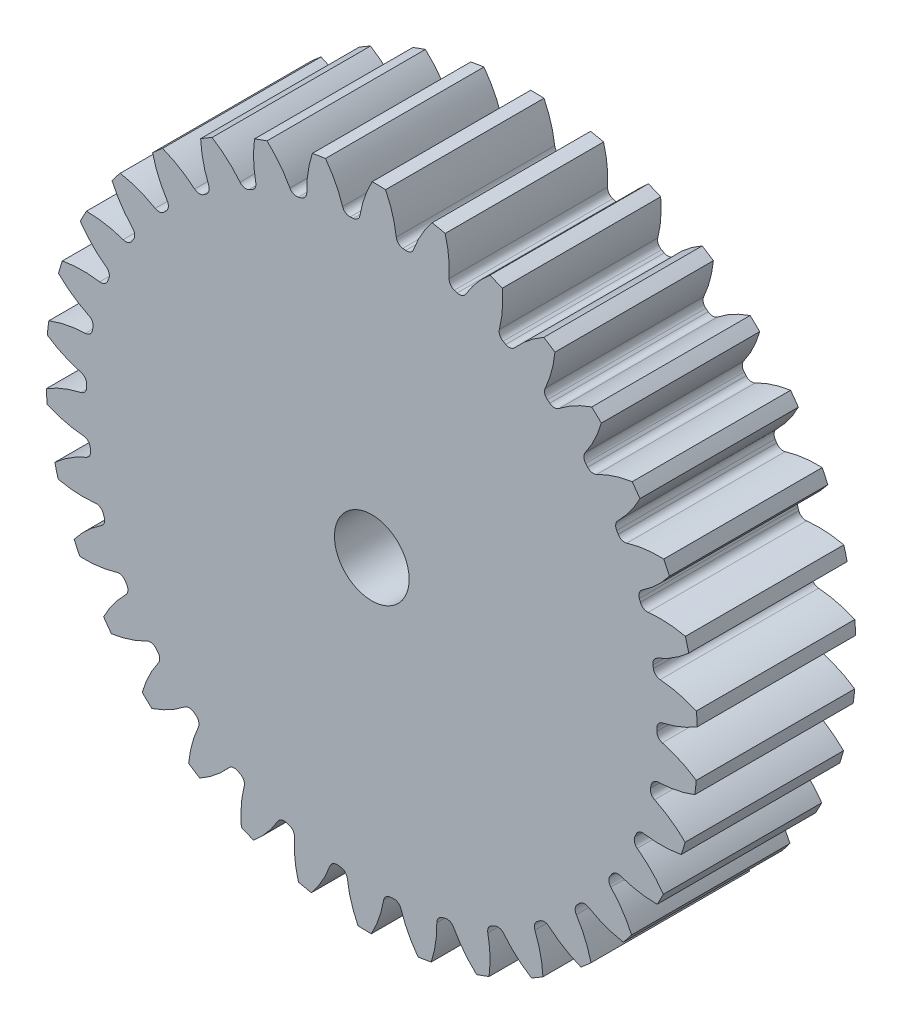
from build123d import *

# Parameters (mm, degrees)
SKETCH3_R         = 182.88
GEARBODY_DEPTH    = 88.9
TOOTHCUT_DEPTH    = 274.483818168
CIRPATTERN1_COUNT = 34
BOREDIA_R         = 20.955
BORE_DEPTH        = 12700


with BuildPart() as part:
    # Sketch3 → gearBody (new body)
    with BuildSketch(Plane.XY):
        Circle(SKETCH3_R)
    extrude(amount=GEARBODY_DEPTH)

    # Sketch2 → toothCut (cut, through all)
    with BuildSketch(Plane.XY):
        with BuildLine():
            ThreePointArc((159.961095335, -4.341472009), (159.981776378, -3.497374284), (159.998003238, -2.653179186))
            ThreePointArc((159.998003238, -2.653179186), (160.932857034, -0.102360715), (163.248813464, 1.317840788))
            ThreePointArc((163.248813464, 1.317840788), (173.40703539, 4.47060639), (182.88, 9.307169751))
            ThreePointArc((182.88, 9.307169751), (183.072937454, -4.002171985), (182.298549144, -17.290366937))
            ThreePointArc((182.298549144, -17.290366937), (173.045998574, -12.044443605), (163.035261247, -8.450762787))
            ThreePointArc((163.035261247, -8.450762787), (160.783581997, -6.930707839), (159.961095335, -4.341472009))
        make_face()
    toothcut = extrude(amount=TOOTHCUT_DEPTH, mode=Mode.SUBTRACT)

    # CirPattern1: toothCut ×34 about axis
    cirpattern1_axis = Axis((0, 0, 0), (0, 0, 1))
    for i in range(1, CIRPATTERN1_COUNT):
        add(toothcut.rotate(cirpattern1_axis, i * 360 / CIRPATTERN1_COUNT), mode=Mode.SUBTRACT)

    # boreDia → bore (cut, symmetric)
    with BuildSketch(Plane.XY):
        Circle(BOREDIA_R)
    extrude(amount=BORE_DEPTH, both=True, mode=Mode.SUBTRACT)


solid = part.part
